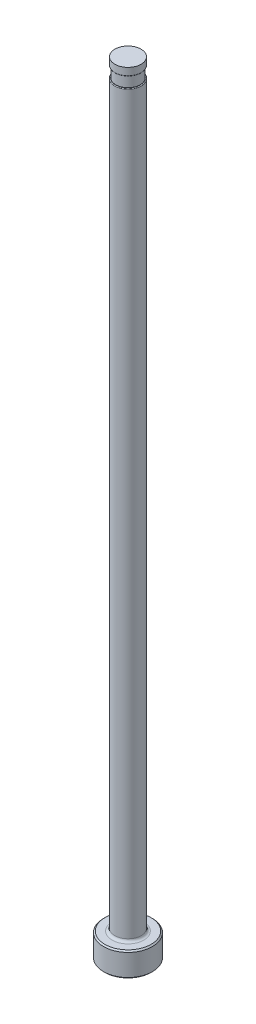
ISO-10303-21;
HEADER;
FILE_DESCRIPTION(('STEP AP214'),'2;1');
FILE_NAME('part.step','',(''),(''),'','','');
FILE_SCHEMA(('AUTOMOTIVE_DESIGN { 1 0 10303 214 1 1 1 1 }'));
ENDSEC;
DATA;
#1=APPLICATION_CONTEXT('core data for automotive mechanical design processes');
#2=APPLICATION_PROTOCOL_DEFINITION('international standard','automotive_design',2000,#1);
#3=PRODUCT_CONTEXT('',#1,'mechanical');
#4=PRODUCT('Part','Part','',(#3));
#5=PRODUCT_RELATED_PRODUCT_CATEGORY('part','',(#4));
#6=PRODUCT_DEFINITION_FORMATION('','',#4);
#7=PRODUCT_DEFINITION_CONTEXT('part definition',#1,'design');
#8=PRODUCT_DEFINITION('design','',#6,#7);
#9=PRODUCT_DEFINITION_SHAPE('','',#8);
#10=(LENGTH_UNIT() NAMED_UNIT(*) SI_UNIT(.MILLI.,.METRE.));
#11=(NAMED_UNIT(*) PLANE_ANGLE_UNIT() SI_UNIT($,.RADIAN.));
#12=(NAMED_UNIT(*) SI_UNIT($,.STERADIAN.) SOLID_ANGLE_UNIT());
#13=UNCERTAINTY_MEASURE_WITH_UNIT(LENGTH_MEASURE(1.E-05),#10,'distance_accuracy_value','');
#14=(GEOMETRIC_REPRESENTATION_CONTEXT(3) GLOBAL_UNCERTAINTY_ASSIGNED_CONTEXT((#13)) GLOBAL_UNIT_ASSIGNED_CONTEXT((#10,
#11,#12)) REPRESENTATION_CONTEXT('',''));
#15=CARTESIAN_POINT('',(0.,0.,0.));
#16=DIRECTION('',(0.,0.,1.));
#17=DIRECTION('',(1.,0.,0.));
#18=AXIS2_PLACEMENT_3D('',#15,#16,#17);
#19=CARTESIAN_POINT('',(-2.57936999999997,150.876,0.));
#20=DIRECTION('',(0.,1.,0.));
#21=DIRECTION('',(0.,0.,1.));
#22=AXIS2_PLACEMENT_3D('',#19,#20,#21);
#23=PLANE('',#22);
#24=CARTESIAN_POINT('',(0.,150.876,0.));
#25=DIRECTION('',(0.,1.,0.));
#26=DIRECTION('',(0.,0.,1.));
#27=AXIS2_PLACEMENT_3D('',#24,#25,#26);
#28=CIRCLE('',#27,2.42696999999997);
#29=CARTESIAN_POINT('',(0.,150.876,2.42696999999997));
#30=VERTEX_POINT('',#29);
#31=EDGE_CURVE('E11',#30,#30,#28,.F.);
#32=ORIENTED_EDGE('',*,*,#31,.T.);
#33=EDGE_LOOP('',(#32));
#34=FACE_BOUND('',#33,.T.);
#35=CARTESIAN_POINT('',(0.,150.876,0.));
#36=DIRECTION('',(0.,1.,0.));
#37=DIRECTION('',(0.,0.,1.));
#38=AXIS2_PLACEMENT_3D('',#35,#36,#37);
#39=CIRCLE('',#38,2.37616999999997);
#40=CARTESIAN_POINT('',(0.,150.876,2.37616999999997));
#41=VERTEX_POINT('',#40);
#42=EDGE_CURVE('E78',#41,#41,#39,.T.);
#43=ORIENTED_EDGE('',*,*,#42,.T.);
#44=EDGE_LOOP('',(#43));
#45=FACE_BOUND('',#44,.T.);
#46=ADVANCED_FACE('F36',(#34,#45),#23,.F.);
#47=CARTESIAN_POINT('',(0.,259.958771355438,0.));
#48=DIRECTION('',(0.,1.,0.));
#49=DIRECTION('',(0.,0.,1.));
#50=AXIS2_PLACEMENT_3D('',#47,#48,#49);
#51=CYLINDRICAL_SURFACE('',#50,2.57936999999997);
#52=DIRECTION('',(0.,1.,0.));
#53=VECTOR('',#52,1.);
#54=CARTESIAN_POINT('',(-2.37616999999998,259.958771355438,-1.00347681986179));
#55=LINE('',#54,#53);
#56=CARTESIAN_POINT('',(-2.37616999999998,148.717,-1.00347681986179));
#57=VERTEX_POINT('',#56);
#58=CARTESIAN_POINT('',(-2.37616999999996,86.36,-1.00347681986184));
#59=VERTEX_POINT('',#58);
#60=EDGE_CURVE('E73',#57,#59,#55,.F.);
#61=ORIENTED_EDGE('',*,*,#60,.F.);
#62=CARTESIAN_POINT('',(0.,148.717,0.));
#63=DIRECTION('',(0.,-1.,0.));
#64=DIRECTION('',(0.,0.,-1.));
#65=AXIS2_PLACEMENT_3D('',#62,#63,#64);
#66=CIRCLE('',#65,2.57936999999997);
#67=CARTESIAN_POINT('',(-2.37616999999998,148.717,1.00347681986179));
#68=VERTEX_POINT('',#67);
#69=EDGE_CURVE('E51',#57,#68,#66,.T.);
#70=ORIENTED_EDGE('',*,*,#69,.T.);
#71=DIRECTION('',(0.,1.,0.));
#72=VECTOR('',#71,1.);
#73=CARTESIAN_POINT('',(-2.37616999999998,259.958771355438,1.00347681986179));
#74=LINE('',#73,#72);
#75=CARTESIAN_POINT('',(-2.37616999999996,86.36,1.00347681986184));
#76=VERTEX_POINT('',#75);
#77=EDGE_CURVE('E84',#76,#68,#74,.T.);
#78=ORIENTED_EDGE('',*,*,#77,.F.);
#79=CARTESIAN_POINT('',(-2.37616999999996,86.36,-1.00347681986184));
#80=CARTESIAN_POINT('',(-2.3761678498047,86.3266535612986,-1.00347324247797));
#81=CARTESIAN_POINT('',(-2.37669600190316,86.2933219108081,-1.00223238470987));
#82=CARTESIAN_POINT('',(-2.37878830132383,86.2268712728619,-0.997259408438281));
#83=CARTESIAN_POINT('',(-2.3803526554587,86.1937523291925,-0.993526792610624));
#84=CARTESIAN_POINT('',(-2.38657174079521,86.094866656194,-0.978545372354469));
#85=CARTESIAN_POINT('',(-2.39275229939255,86.0297173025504,-0.963512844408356));
#86=CARTESIAN_POINT('',(-2.40858326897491,85.9029814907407,-0.923223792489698));
#87=CARTESIAN_POINT('',(-2.41823988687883,85.8414016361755,-0.897948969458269));
#88=CARTESIAN_POINT('',(-2.4399460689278,85.7240247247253,-0.837167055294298));
#89=CARTESIAN_POINT('',(-2.45199238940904,85.6682199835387,-0.801673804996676));
#90=CARTESIAN_POINT('',(-2.47634550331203,85.5671237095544,-0.722822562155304));
#91=CARTESIAN_POINT('',(-2.48860868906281,85.5214444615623,-0.679950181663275));
#92=CARTESIAN_POINT('',(-2.51236371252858,85.4390631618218,-0.586096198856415));
#93=CARTESIAN_POINT('',(-2.52385591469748,85.4023568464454,-0.535118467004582));
#94=CARTESIAN_POINT('',(-2.54336333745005,85.3428448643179,-0.432311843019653));
#95=CARTESIAN_POINT('',(-2.55161740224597,85.3189816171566,-0.381139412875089));
#96=CARTESIAN_POINT('',(-2.56521925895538,85.28058215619,-0.275047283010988));
#97=CARTESIAN_POINT('',(-2.5705685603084,85.2660410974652,-0.22012954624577));
#98=CARTESIAN_POINT('',(-2.57742936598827,85.2475339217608,-0.112636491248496));
#99=CARTESIAN_POINT('',(-2.57920175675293,85.2428477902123,-0.0602005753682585));
#100=CARTESIAN_POINT('',(-2.57951508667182,85.242013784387,0.0447435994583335));
#101=CARTESIAN_POINT('',(-2.57805674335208,85.2458640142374,0.0972518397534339));
#102=CARTESIAN_POINT('',(-2.57214487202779,85.2617732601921,0.199435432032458));
#103=CARTESIAN_POINT('',(-2.56776943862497,85.2736183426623,0.249148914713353));
#104=CARTESIAN_POINT('',(-2.55654798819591,85.3049461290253,0.345804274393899));
#105=CARTESIAN_POINT('',(-2.54970197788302,85.3244288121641,0.392746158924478));
#106=CARTESIAN_POINT('',(-2.53407309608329,85.37087953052,0.483513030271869));
#107=CARTESIAN_POINT('',(-2.52525719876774,85.3979775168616,0.527265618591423));
#108=CARTESIAN_POINT('',(-2.5066235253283,85.4586856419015,0.609736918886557));
#109=CARTESIAN_POINT('',(-2.49680555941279,85.4922970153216,0.648454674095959));
#110=CARTESIAN_POINT('',(-2.47647062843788,85.5672568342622,0.722358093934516));
#111=CARTESIAN_POINT('',(-2.46594700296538,85.6089479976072,0.757193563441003));
#112=CARTESIAN_POINT('',(-2.44575759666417,85.697357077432,0.820068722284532));
#113=CARTESIAN_POINT('',(-2.43609222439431,85.7440773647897,0.848105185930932));
#114=CARTESIAN_POINT('',(-2.41760539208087,85.8458831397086,0.899528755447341));
#115=CARTESIAN_POINT('',(-2.40894797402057,85.9013422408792,0.922233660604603));
#116=CARTESIAN_POINT('',(-2.39441308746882,86.0153120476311,0.959340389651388));
#117=CARTESIAN_POINT('',(-2.3885356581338,86.0738227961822,0.973742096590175));
#118=CARTESIAN_POINT('',(-2.38160417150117,86.1705543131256,0.990534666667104));
#119=CARTESIAN_POINT('',(-2.37957064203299,86.2082987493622,0.995396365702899));
#120=CARTESIAN_POINT('',(-2.37685226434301,86.2840255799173,1.00186164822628));
#121=CARTESIAN_POINT('',(-2.3761642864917,86.3220072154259,1.00347279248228));
#122=CARTESIAN_POINT('',(-2.37616999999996,86.36,1.00347681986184));
#123=B_SPLINE_CURVE_WITH_KNOTS('',3,(#79,#80,#81,#82,#83,#84,#85,#86,#87,#88,#89,#90,#91,#92,
#93,#94,#95,#96,#97,#98,#99,#100,#101,#102,#103,#104,#105,#106,#107,#108,#109,#110,#111,#112,
#113,#114,#115,#116,#117,#118,#119,#120,#121,#122),.UNSPECIFIED.,.F.,.F.,(4,2,2,2,2,2,2,2,2,2,2,
2,2,2,2,2,2,2,2,2,2,4),(0.,0.0999820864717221,0.199984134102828,0.400421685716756,
0.601218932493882,0.801745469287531,0.992181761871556,1.18252738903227,1.35280353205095,
1.52299110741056,1.68023815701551,1.83745028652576,1.99061412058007,2.14377753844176,
2.29973239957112,2.45571685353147,2.62103910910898,2.78643964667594,2.96734496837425,
3.14825283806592,3.26243374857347,3.37634876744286),.UNSPECIFIED.);
#124=EDGE_CURVE('E81',#59,#76,#123,.T.);
#125=ORIENTED_EDGE('',*,*,#124,.F.);
#126=EDGE_LOOP('',(#61,#70,#78,#125));
#127=FACE_BOUND('',#126,.T.);
#128=CARTESIAN_POINT('',(0.,5.25779999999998,0.));
#129=DIRECTION('',(0.,1.,0.));
#130=DIRECTION('',(0.,0.,1.));
#131=AXIS2_PLACEMENT_3D('',#128,#129,#130);
#132=CIRCLE('',#131,2.57936999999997);
#133=CARTESIAN_POINT('',(0.,5.25779999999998,2.57936999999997));
#134=VERTEX_POINT('',#133);
#135=EDGE_CURVE('E116',#134,#134,#132,.T.);
#136=ORIENTED_EDGE('',*,*,#135,.T.);
#137=EDGE_LOOP('',(#136));
#138=FACE_BOUND('',#137,.T.);
#139=ADVANCED_FACE('F82',(#127,#138),#51,.T.);
#140=CARTESIAN_POINT('',(0.,0.,0.));
#141=DIRECTION('',(0.,-1.,0.));
#142=DIRECTION('',(0.,0.,-1.));
#143=AXIS2_PLACEMENT_3D('',#140,#141,#142);
#144=PLANE('',#143);
#145=CARTESIAN_POINT('',(0.,0.,0.));
#146=DIRECTION('',(0.,-1.,0.));
#147=DIRECTION('',(0.,0.,-1.));
#148=AXIS2_PLACEMENT_3D('',#145,#146,#147);
#149=CIRCLE('',#148,4.50849999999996);
#150=CARTESIAN_POINT('',(0.,0.,-4.50849999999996));
#151=VERTEX_POINT('',#150);
#152=EDGE_CURVE('E113',#151,#151,#149,.T.);
#153=ORIENTED_EDGE('',*,*,#152,.T.);
#154=EDGE_LOOP('',(#153));
#155=FACE_BOUND('',#154,.T.);
#156=ADVANCED_FACE('F192',(#155),#144,.T.);
#157=CARTESIAN_POINT('',(0.,259.958771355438,0.));
#158=DIRECTION('',(0.,1.,0.));
#159=DIRECTION('',(0.,0.,1.));
#160=AXIS2_PLACEMENT_3D('',#157,#158,#159);
#161=CYLINDRICAL_SURFACE('',#160,4.76249999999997);
#162=CARTESIAN_POINT('',(0.,4.49579999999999,0.));
#163=DIRECTION('',(0.,1.,0.));
#164=DIRECTION('',(0.,0.,1.));
#165=AXIS2_PLACEMENT_3D('',#162,#163,#164);
#166=CIRCLE('',#165,4.76249999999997);
#167=CARTESIAN_POINT('',(0.,4.49579999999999,4.76249999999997));
#168=VERTEX_POINT('',#167);
#169=EDGE_CURVE('E110',#168,#168,#166,.F.);
#170=ORIENTED_EDGE('',*,*,#169,.T.);
#171=EDGE_LOOP('',(#170));
#172=FACE_BOUND('',#171,.T.);
#173=CARTESIAN_POINT('',(0.,0.254000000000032,0.));
#174=DIRECTION('',(0.,-1.,0.));
#175=DIRECTION('',(0.,0.,-1.));
#176=AXIS2_PLACEMENT_3D('',#173,#174,#175);
#177=CIRCLE('',#176,4.76249999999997);
#178=CARTESIAN_POINT('',(0.,0.254000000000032,-4.76249999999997));
#179=VERTEX_POINT('',#178);
#180=EDGE_CURVE('E107',#179,#179,#177,.F.);
#181=ORIENTED_EDGE('',*,*,#180,.T.);
#182=EDGE_LOOP('',(#181));
#183=FACE_BOUND('',#182,.T.);
#184=ADVANCED_FACE('F195',(#172,#183),#161,.T.);
#185=CARTESIAN_POINT('',(-4.76249999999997,4.7498,0.));
#186=DIRECTION('',(0.,1.,0.));
#187=DIRECTION('',(0.,0.,1.));
#188=AXIS2_PLACEMENT_3D('',#185,#186,#187);
#189=PLANE('',#188);
#190=CARTESIAN_POINT('',(0.,4.7498,0.));
#191=DIRECTION('',(0.,1.,0.));
#192=DIRECTION('',(0.,0.,1.));
#193=AXIS2_PLACEMENT_3D('',#190,#191,#192);
#194=CIRCLE('',#193,3.08736999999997);
#195=CARTESIAN_POINT('',(0.,4.7498,3.08736999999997));
#196=VERTEX_POINT('',#195);
#197=EDGE_CURVE('E87',#196,#196,#194,.F.);
#198=ORIENTED_EDGE('',*,*,#197,.T.);
#199=EDGE_LOOP('',(#198));
#200=FACE_BOUND('',#199,.T.);
#201=CARTESIAN_POINT('',(0.,4.7498,0.));
#202=DIRECTION('',(0.,1.,0.));
#203=DIRECTION('',(0.,0.,1.));
#204=AXIS2_PLACEMENT_3D('',#201,#202,#203);
#205=CIRCLE('',#204,4.50849999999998);
#206=CARTESIAN_POINT('',(0.,4.7498,4.50849999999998));
#207=VERTEX_POINT('',#206);
#208=EDGE_CURVE('E104',#207,#207,#205,.T.);
#209=ORIENTED_EDGE('',*,*,#208,.T.);
#210=EDGE_LOOP('',(#209));
#211=FACE_BOUND('',#210,.T.);
#212=ADVANCED_FACE('F190',(#200,#211),#189,.T.);
#213=CARTESIAN_POINT('',(0.,4.74980000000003,0.));
#214=DIRECTION('',(0.,-1.,0.));
#215=DIRECTION('',(0.,0.,-1.));
#216=AXIS2_PLACEMENT_3D('',#213,#214,#215);
#217=CONICAL_SURFACE('',#216,4.50849999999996,0.785398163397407);
#218=ORIENTED_EDGE('',*,*,#169,.F.);
#219=EDGE_LOOP('',(#218));
#220=FACE_BOUND('',#219,.T.);
#221=ORIENTED_EDGE('',*,*,#208,.F.);
#222=EDGE_LOOP('',(#221));
#223=FACE_BOUND('',#222,.T.);
#224=ADVANCED_FACE('F186',(#220,#223),#217,.T.);
#225=CARTESIAN_POINT('',(0.,0.254000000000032,0.));
#226=DIRECTION('',(0.,1.,0.));
#227=DIRECTION('',(0.,0.,1.));
#228=AXIS2_PLACEMENT_3D('',#225,#226,#227);
#229=CONICAL_SURFACE('',#228,4.76249999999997,0.785398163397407);
#230=ORIENTED_EDGE('',*,*,#152,.F.);
#231=EDGE_LOOP('',(#230));
#232=FACE_BOUND('',#231,.T.);
#233=ORIENTED_EDGE('',*,*,#180,.F.);
#234=EDGE_LOOP('',(#233));
#235=FACE_BOUND('',#234,.T.);
#236=ADVANCED_FACE('F182',(#232,#235),#229,.T.);
#237=CARTESIAN_POINT('',(0.,5.25779999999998,0.));
#238=DIRECTION('',(0.,1.,0.));
#239=DIRECTION('',(0.,0.,1.));
#240=AXIS2_PLACEMENT_3D('',#237,#238,#239);
#241=TOROIDAL_SURFACE('',#240,3.08736999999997,0.508);
#242=ORIENTED_EDGE('',*,*,#197,.F.);
#243=EDGE_LOOP('',(#242));
#244=FACE_BOUND('',#243,.T.);
#245=ORIENTED_EDGE('',*,*,#135,.F.);
#246=EDGE_LOOP('',(#245));
#247=FACE_BOUND('',#246,.T.);
#248=ADVANCED_FACE('F147',(#244,#247),#241,.F.);
#249=CARTESIAN_POINT('',(-2.57936999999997,148.844,0.));
#250=DIRECTION('',(0.,-1.,0.));
#251=DIRECTION('',(0.,0.,-1.));
#252=AXIS2_PLACEMENT_3D('',#249,#250,#251);
#253=PLANE('',#252);
#254=DIRECTION('',(0.,0.,1.));
#255=VECTOR('',#254,1.);
#256=CARTESIAN_POINT('',(-2.37616999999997,148.844,0.));
#257=LINE('',#256,#255);
#258=CARTESIAN_POINT('',(-2.37616999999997,148.844,0.));
#259=VERTEX_POINT('',#258);
#260=CARTESIAN_POINT('',(-2.37616999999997,148.844,0.60657625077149));
#261=VERTEX_POINT('',#260);
#262=EDGE_CURVE('E90',#259,#261,#257,.T.);
#263=ORIENTED_EDGE('',*,*,#262,.T.);
#264=CARTESIAN_POINT('',(0.,148.844,0.));
#265=DIRECTION('',(0.,-1.,0.));
#266=DIRECTION('',(0.,0.,-1.));
#267=AXIS2_PLACEMENT_3D('',#264,#265,#266);
#268=CIRCLE('',#267,2.45236999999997);
#269=CARTESIAN_POINT('',(-2.37616999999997,148.844,-0.60657625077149));
#270=VERTEX_POINT('',#269);
#271=EDGE_CURVE('E86',#261,#270,#268,.F.);
#272=ORIENTED_EDGE('',*,*,#271,.T.);
#273=EDGE_CURVE('E79',#270,#259,#257,.T.);
#274=ORIENTED_EDGE('',*,*,#273,.T.);
#275=CARTESIAN_POINT('',(0.,148.844,0.));
#276=DIRECTION('',(0.,1.,0.));
#277=DIRECTION('',(0.,0.,1.));
#278=AXIS2_PLACEMENT_3D('',#275,#276,#277);
#279=CIRCLE('',#278,2.37616999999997);
#280=EDGE_CURVE('E101',#259,#259,#279,.T.);
#281=ORIENTED_EDGE('',*,*,#280,.F.);
#282=EDGE_LOOP('',(#263,#272,#274,#281));
#283=FACE_BOUND('',#282,.T.);
#284=ADVANCED_FACE('F144',(#283),#253,.F.);
#285=CARTESIAN_POINT('',(0.,153.448281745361,0.));
#286=DIRECTION('',(0.,1.,0.));
#287=DIRECTION('',(0.,0.,1.));
#288=AXIS2_PLACEMENT_3D('',#285,#286,#287);
#289=CYLINDRICAL_SURFACE('',#288,2.37616999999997);
#290=ORIENTED_EDGE('',*,*,#42,.F.);
#291=EDGE_LOOP('',(#290));
#292=FACE_BOUND('',#291,.T.);
#293=ORIENTED_EDGE('',*,*,#280,.T.);
#294=EDGE_LOOP('',(#293));
#295=FACE_BOUND('',#294,.T.);
#296=ADVANCED_FACE('F141',(#292,#295),#289,.T.);
#297=CARTESIAN_POINT('',(-2.37616999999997,149.86,-4.76249999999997));
#298=DIRECTION('',(1.,0.,0.));
#299=DIRECTION('',(0.,1.,0.));
#300=AXIS2_PLACEMENT_3D('',#297,#298,#299);
#301=PLANE('',#300);
#302=ORIENTED_EDGE('',*,*,#273,.F.);
#303=CARTESIAN_POINT('',(-2.37616999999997,148.844,-0.60657625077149));
#304=CARTESIAN_POINT('',(-2.37616999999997,148.843986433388,-0.627774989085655));
#305=CARTESIAN_POINT('',(-2.37616999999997,148.843673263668,-0.648986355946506));
#306=CARTESIAN_POINT('',(-2.37616999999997,148.842169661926,-0.691484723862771));
#307=CARTESIAN_POINT('',(-2.37616999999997,148.840974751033,-0.712771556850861));
#308=CARTESIAN_POINT('',(-2.37616999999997,148.837417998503,-0.755326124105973));
#309=CARTESIAN_POINT('',(-2.37616999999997,148.835052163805,-0.776593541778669));
#310=CARTESIAN_POINT('',(-2.37616999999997,148.828718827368,-0.818863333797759));
#311=CARTESIAN_POINT('',(-2.37616999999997,148.824755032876,-0.839866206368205));
#312=CARTESIAN_POINT('',(-2.37616999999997,148.817365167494,-0.869601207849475));
#313=CARTESIAN_POINT('',(-2.37616999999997,148.814897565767,-0.878570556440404));
#314=CARTESIAN_POINT('',(-2.37616999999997,148.809395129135,-0.896363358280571));
#315=CARTESIAN_POINT('',(-2.37616999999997,148.806358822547,-0.905186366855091));
#316=CARTESIAN_POINT('',(-2.37616999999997,148.799046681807,-0.923923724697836));
#317=CARTESIAN_POINT('',(-2.37616999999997,148.794651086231,-0.933791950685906));
#318=CARTESIAN_POINT('',(-2.37616999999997,148.784570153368,-0.952838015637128));
#319=CARTESIAN_POINT('',(-2.37616999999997,148.778891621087,-0.962019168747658));
#320=CARTESIAN_POINT('',(-2.37616999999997,148.769665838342,-0.973806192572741));
#321=CARTESIAN_POINT('',(-2.37616999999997,148.766910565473,-0.977026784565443));
#322=CARTESIAN_POINT('',(-2.37616999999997,148.761048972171,-0.983149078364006));
#323=CARTESIAN_POINT('',(-2.37616999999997,148.757942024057,-0.98605019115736));
#324=CARTESIAN_POINT('',(-2.37616999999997,148.751290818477,-0.991423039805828));
#325=CARTESIAN_POINT('',(-2.37616999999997,148.747740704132,-0.993887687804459));
#326=CARTESIAN_POINT('',(-2.37616999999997,148.740248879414,-0.998099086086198));
#327=CARTESIAN_POINT('',(-2.37616999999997,148.7363097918,-0.999850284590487));
#328=CARTESIAN_POINT('',(-2.37616999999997,148.729771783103,-1.00188288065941));
#329=CARTESIAN_POINT('',(-2.37616999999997,148.727268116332,-1.00247204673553));
#330=CARTESIAN_POINT('',(-2.37616999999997,148.722178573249,-1.00327288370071));
#331=CARTESIAN_POINT('',(-2.37616999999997,148.719592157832,-1.00348108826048));
#332=CARTESIAN_POINT('',(-2.37616999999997,148.717,-1.00347681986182));
#333=B_SPLINE_CURVE_WITH_KNOTS('',3,(#303,#304,#305,#306,#307,#308,#309,#310,#311,#312,#313,
#314,#315,#316,#317,#318,#319,#320,#321,#322,#323,#324,#325,#326,#327,#328,#329,#330,#331,#332),
.UNSPECIFIED.,.F.,.F.,(4,2,2,2,2,2,2,2,2,2,2,2,2,2,4),(0.,0.0636141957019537,0.127553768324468,
0.191712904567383,0.255724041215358,0.283618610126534,0.311586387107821,0.343944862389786,
0.376135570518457,0.388831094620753,0.401549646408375,0.414458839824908,0.427286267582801,
0.434975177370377,0.4427337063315),.UNSPECIFIED.);
#334=EDGE_CURVE('E59',#270,#57,#333,.T.);
#335=ORIENTED_EDGE('',*,*,#334,.T.);
#336=ORIENTED_EDGE('',*,*,#60,.T.);
#337=DIRECTION('',(0.,0.,1.));
#338=VECTOR('',#337,1.);
#339=CARTESIAN_POINT('',(-2.37616999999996,86.36,-4.76249999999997));
#340=LINE('',#339,#338);
#341=EDGE_CURVE('E77',#59,#76,#340,.T.);
#342=ORIENTED_EDGE('',*,*,#341,.T.);
#343=ORIENTED_EDGE('',*,*,#77,.T.);
#344=CARTESIAN_POINT('',(-2.37616999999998,148.717,1.00347681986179));
#345=CARTESIAN_POINT('',(-2.37616999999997,148.72008677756,1.00348533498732));
#346=CARTESIAN_POINT('',(-2.37616999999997,148.723162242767,1.00318798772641));
#347=CARTESIAN_POINT('',(-2.37616999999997,148.729176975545,1.00206106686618));
#348=CARTESIAN_POINT('',(-2.37616999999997,148.732117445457,1.00123801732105));
#349=CARTESIAN_POINT('',(-2.37616999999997,148.738507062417,0.998885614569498));
#350=CARTESIAN_POINT('',(-2.37616999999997,148.741910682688,0.997234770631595));
#351=CARTESIAN_POINT('',(-2.37616999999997,148.748418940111,0.993404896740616));
#352=CARTESIAN_POINT('',(-2.37616999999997,148.751521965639,0.99122321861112));
#353=CARTESIAN_POINT('',(-2.37616999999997,148.759245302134,0.985017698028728));
#354=CARTESIAN_POINT('',(-2.37616999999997,148.76361779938,0.980688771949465));
#355=CARTESIAN_POINT('',(-2.37616999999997,148.771686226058,0.971452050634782));
#356=CARTESIAN_POINT('',(-2.37616999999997,148.775380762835,0.966543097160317));
#357=CARTESIAN_POINT('',(-2.37616999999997,148.785861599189,0.950989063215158));
#358=CARTESIAN_POINT('',(-2.37616999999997,148.791783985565,0.939769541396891));
#359=CARTESIAN_POINT('',(-2.37616999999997,148.802142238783,0.916677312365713));
#360=CARTESIAN_POINT('',(-2.37616999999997,148.806573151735,0.904802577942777));
#361=CARTESIAN_POINT('',(-2.37616999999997,148.816828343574,0.873126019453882));
#362=CARTESIAN_POINT('',(-2.37616999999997,148.821772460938,0.853042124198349));
#363=CARTESIAN_POINT('',(-2.37616999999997,148.829834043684,0.812501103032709));
#364=CARTESIAN_POINT('',(-2.37616999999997,148.832947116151,0.792043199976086));
#365=CARTESIAN_POINT('',(-2.37616999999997,148.840347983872,0.730361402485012));
#366=CARTESIAN_POINT('',(-2.37616999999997,148.842678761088,0.688903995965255));
#367=CARTESIAN_POINT('',(-2.37616999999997,148.843717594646,0.640645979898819));
#368=CARTESIAN_POINT('',(-2.37616999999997,148.8438254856,0.633819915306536));
#369=CARTESIAN_POINT('',(-2.37616999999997,148.843967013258,0.620188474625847));
#370=CARTESIAN_POINT('',(-2.37616999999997,148.844000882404,0.613383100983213));
#371=CARTESIAN_POINT('',(-2.37616999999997,148.844,0.606576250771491));
#372=B_SPLINE_CURVE_WITH_KNOTS('',3,(#344,#345,#346,#347,#348,#349,#350,#351,#352,#353,#354,
#355,#356,#357,#358,#359,#360,#361,#362,#363,#364,#365,#366,#367,#368,#369,#370,#371),
.UNSPECIFIED.,.F.,.F.,(4,2,2,2,2,2,2,2,2,2,2,2,2,4),(0.,0.00922779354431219,0.0183432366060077,
0.0296284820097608,0.0409712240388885,0.0593256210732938,0.0777173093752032,0.115565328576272,
0.153537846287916,0.215427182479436,0.277464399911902,0.401767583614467,0.422249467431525,
0.442666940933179),.UNSPECIFIED.);
#373=EDGE_CURVE('E172',#68,#261,#372,.T.);
#374=ORIENTED_EDGE('',*,*,#373,.T.);
#375=ORIENTED_EDGE('',*,*,#262,.F.);
#376=EDGE_LOOP('',(#302,#335,#336,#342,#343,#374,#375));
#377=FACE_BOUND('',#376,.T.);
#378=ADVANCED_FACE('F75',(#377),#301,.F.);
#379=CARTESIAN_POINT('',(-5.55116999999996,86.36,-4.76249999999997));
#380=DIRECTION('',(0.,0.,1.));
#381=DIRECTION('',(1.,0.,0.));
#382=AXIS2_PLACEMENT_3D('',#379,#380,#381);
#383=CYLINDRICAL_SURFACE('',#382,3.175);
#384=ORIENTED_EDGE('',*,*,#341,.F.);
#385=ORIENTED_EDGE('',*,*,#124,.T.);
#386=EDGE_LOOP('',(#384,#385));
#387=FACE_BOUND('',#386,.T.);
#388=ADVANCED_FACE('F89',(#387),#383,.F.);
#389=CARTESIAN_POINT('',(0.,152.687735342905,0.));
#390=DIRECTION('',(0.,1.,0.));
#391=DIRECTION('',(0.,0.,1.));
#392=AXIS2_PLACEMENT_3D('',#389,#390,#391);
#393=CYLINDRICAL_SURFACE('',#392,2.55396999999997);
#394=CARTESIAN_POINT('',(0.,151.003,0.));
#395=DIRECTION('',(0.,1.,0.));
#396=DIRECTION('',(0.,0.,1.));
#397=AXIS2_PLACEMENT_3D('',#394,#395,#396);
#398=CIRCLE('',#397,2.55396999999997);
#399=CARTESIAN_POINT('',(0.,151.003,2.55396999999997));
#400=VERTEX_POINT('',#399);
#401=EDGE_CURVE('E44',#400,#400,#398,.T.);
#402=ORIENTED_EDGE('',*,*,#401,.T.);
#403=EDGE_LOOP('',(#402));
#404=FACE_BOUND('',#403,.T.);
#405=CARTESIAN_POINT('',(0.,152.4,0.));
#406=DIRECTION('',(0.,1.,0.));
#407=DIRECTION('',(0.,0.,1.));
#408=AXIS2_PLACEMENT_3D('',#405,#406,#407);
#409=CIRCLE('',#408,2.55396999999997);
#410=CARTESIAN_POINT('',(0.,152.4,2.55396999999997));
#411=VERTEX_POINT('',#410);
#412=EDGE_CURVE('E91',#411,#411,#409,.T.);
#413=ORIENTED_EDGE('',*,*,#412,.F.);
#414=EDGE_LOOP('',(#413));
#415=FACE_BOUND('',#414,.T.);
#416=ADVANCED_FACE('F135',(#404,#415),#393,.T.);
#417=CARTESIAN_POINT('',(-2.57936999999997,152.4,0.));
#418=DIRECTION('',(0.,1.,0.));
#419=DIRECTION('',(0.,0.,1.));
#420=AXIS2_PLACEMENT_3D('',#417,#418,#419);
#421=PLANE('',#420);
#422=ORIENTED_EDGE('',*,*,#412,.T.);
#423=EDGE_LOOP('',(#422));
#424=FACE_BOUND('',#423,.T.);
#425=ADVANCED_FACE('F149',(#424),#421,.T.);
#426=CARTESIAN_POINT('',(0.,148.717,0.));
#427=DIRECTION('',(0.,-1.,0.));
#428=DIRECTION('',(0.,0.,-1.));
#429=AXIS2_PLACEMENT_3D('',#426,#427,#428);
#430=TOROIDAL_SURFACE('',#429,2.45236999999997,0.127);
#431=ORIENTED_EDGE('',*,*,#373,.F.);
#432=ORIENTED_EDGE('',*,*,#69,.F.);
#433=ORIENTED_EDGE('',*,*,#334,.F.);
#434=ORIENTED_EDGE('',*,*,#271,.F.);
#435=EDGE_LOOP('',(#431,#432,#433,#434));
#436=FACE_BOUND('',#435,.T.);
#437=ADVANCED_FACE('F151',(#436),#430,.T.);
#438=CARTESIAN_POINT('',(0.,151.003,0.));
#439=DIRECTION('',(0.,1.,0.));
#440=DIRECTION('',(0.,0.,1.));
#441=AXIS2_PLACEMENT_3D('',#438,#439,#440);
#442=TOROIDAL_SURFACE('',#441,2.42696999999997,0.127);
#443=ORIENTED_EDGE('',*,*,#31,.F.);
#444=EDGE_LOOP('',(#443));
#445=FACE_BOUND('',#444,.T.);
#446=ORIENTED_EDGE('',*,*,#401,.F.);
#447=EDGE_LOOP('',(#446));
#448=FACE_BOUND('',#447,.T.);
#449=ADVANCED_FACE('F38',(#445,#448),#442,.T.);
#450=CLOSED_SHELL('',(#46,#139,#156,#184,#212,#224,#236,#248,#284,#296,#378,#388,#416,#425,#437,#449));
#451=MANIFOLD_SOLID_BREP('B2',#450);
#452=ADVANCED_BREP_SHAPE_REPRESENTATION('',(#18,#451),#14);
#453=SHAPE_DEFINITION_REPRESENTATION(#9,#452);
ENDSEC;
END-ISO-10303-21;
